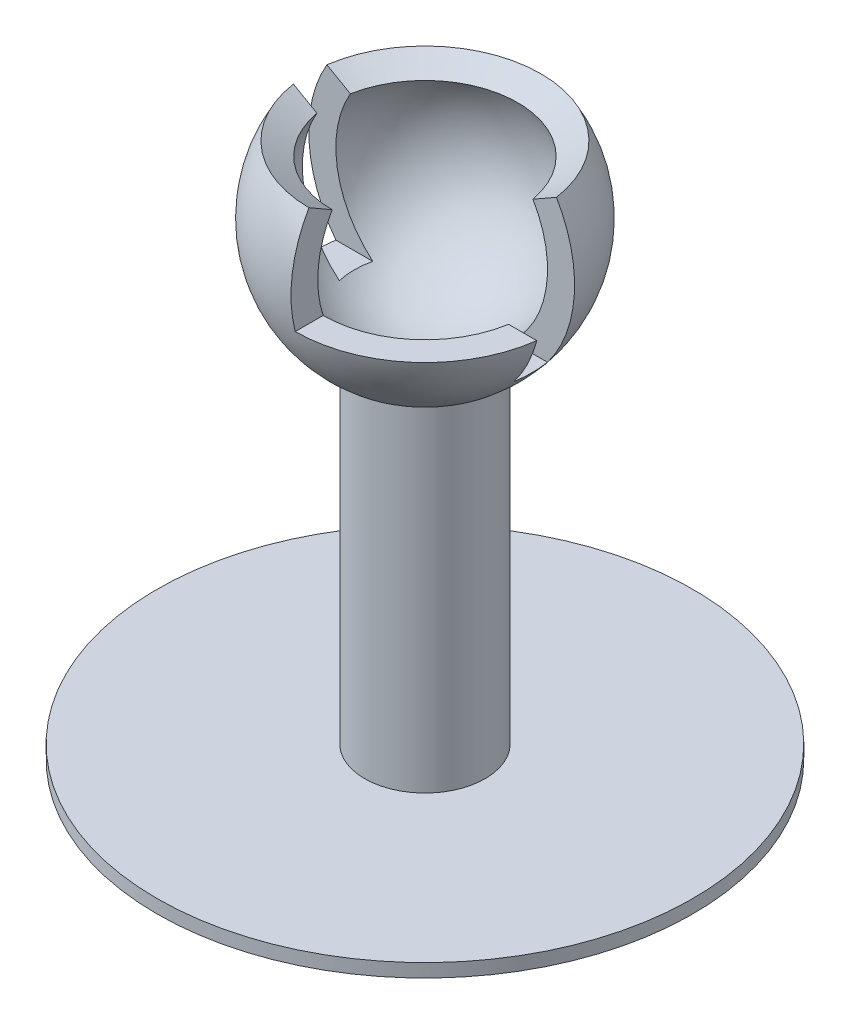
from build123d import *

# Parameters (mm, degrees)
ESQUISSE2_R             = 40
BOSS_EXTRU_2_DEPTH      = 2
BOSS_EXTRU_3_REACH      = 98.354
BOSS_EXTRU_3_END_RADIUS = 20
ESQUISSE3_R             = 9
ESQUISSE4_W             = 27.394765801
ESQUISSE4_H             = 26.309824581
ENL_V_MAT_EXTRU_1_DEPTH = 15
ENL_V_MAT_EXTRU_2_DEPTH = 2.5


with BuildPart() as part:
    # Esquisse2 → Boss.-Extru.2 (new body)
    with BuildSketch(Plane(origin=(0, -70, 0), x_dir=(-1, 0, 0), z_dir=(0, 1, 0))):
        with Locations(Location((0, 0, 0), (0, 0, 90))):
            Circle(ESQUISSE2_R)
    extrude(amount=BOSS_EXTRU_2_DEPTH)



with BuildPart() as body_2:
    # Esquisse1 → R_volution1 (revolve)
    with BuildSketch(Plane.XY, mode=Mode.PRIVATE) as r_volution1_sk:
        with BuildLine():
            Line((0, -16), (0, -20))
            ThreePointArc((0, -20), (17.320508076, -10), (17.320508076, 10))
            Line((17.320508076, 10), (13.856406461, 8))
            ThreePointArc((13.856406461, 8), (13.856406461, -8), (0, -16))
        make_face()
    revolve(r_volution1_sk.sketch.rotate(Axis((0, 21.411150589, 0), (0, -1, 0)), 90), axis=Axis((0, 21.411150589, 0), (0, -1, 0)))


with BuildPart() as part_1:
    add(part.part)

    add(body_2.part)  # Boss.-Extru.3 merges body 2
    # Boss.-Extru.3: up to this sphere (the profile starts outside it)
    boss_extru_3_end = Location((0, 0, 0)) * Sphere(BOSS_EXTRU_3_END_RADIUS, mode=Mode.PRIVATE)
    # Esquisse3 → Boss.-Extru.3 (add, up to the surface)
    with BuildSketch(Plane(origin=(0, -68, 0), x_dir=(1, 0, 0), z_dir=(0, 1, 0)), mode=Mode.PRIVATE) as boss_extru_3_sk1:
        with Locations(Location((0, 0, 0), (0, 0, 180))):
            Circle(ESQUISSE3_R)
    boss_extru_3_tool1 = extrude(boss_extru_3_sk1.sketch, amount=BOSS_EXTRU_3_REACH, mode=Mode.PRIVATE) - boss_extru_3_end
    add(boss_extru_3_tool1.solids().sort_by_distance((0, -68, 0))[0])

    # Esquisse4 → Enl_v. mat.-Extru.1 (cut)
    with BuildSketch(Plane.XZ.offset(-10)):
        with Locations((13.697382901, 13.154912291)):
            Rectangle(ESQUISSE4_W, ESQUISSE4_H)
    extrude(amount=ENL_V_MAT_EXTRU_1_DEPTH, mode=Mode.SUBTRACT)

    # Esquisse6 → Enl_v. mat.-Extru.2 (cut, symmetric)
    with BuildSketch(Plane.XY):
        with BuildLine():
            Line((-16, -12), (16, -12))
            ThreePointArc((16, -12), (19.96406934, -1.198305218), (17.320508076, 10))
            Line((17.320508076, 10), (-17.320508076, 10))
            ThreePointArc((-17.320508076, 10), (-19.96406934, -1.198305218), (-16, -12))
        make_face()
    extrude(amount=ENL_V_MAT_EXTRU_2_DEPTH, both=True, mode=Mode.SUBTRACT)


solid = part_1.part
